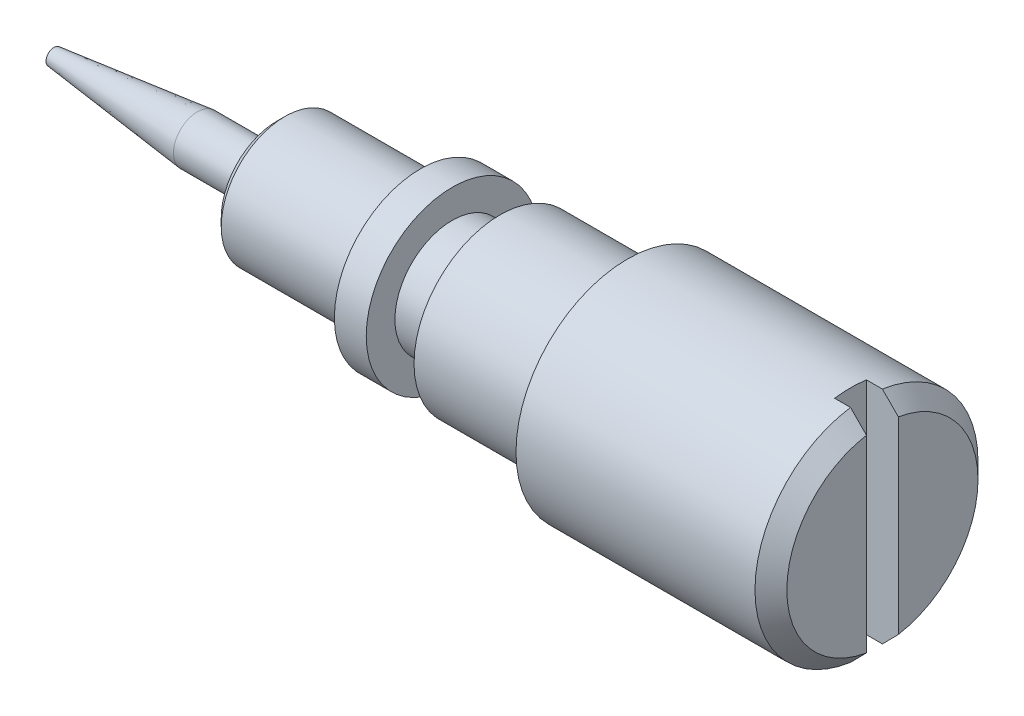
ISO-10303-21;
HEADER;
FILE_DESCRIPTION(('STEP AP214'),'2;1');
FILE_NAME('part.step','',(''),(''),'','','');
FILE_SCHEMA(('AUTOMOTIVE_DESIGN { 1 0 10303 214 1 1 1 1 }'));
ENDSEC;
DATA;
#1=APPLICATION_CONTEXT('core data for automotive mechanical design processes');
#2=APPLICATION_PROTOCOL_DEFINITION('international standard','automotive_design',2000,#1);
#3=PRODUCT_CONTEXT('',#1,'mechanical');
#4=PRODUCT('Part','Part','',(#3));
#5=PRODUCT_RELATED_PRODUCT_CATEGORY('part','',(#4));
#6=PRODUCT_DEFINITION_FORMATION('','',#4);
#7=PRODUCT_DEFINITION_CONTEXT('part definition',#1,'design');
#8=PRODUCT_DEFINITION('design','',#6,#7);
#9=PRODUCT_DEFINITION_SHAPE('','',#8);
#10=(LENGTH_UNIT() NAMED_UNIT(*) SI_UNIT(.MILLI.,.METRE.));
#11=(NAMED_UNIT(*) PLANE_ANGLE_UNIT() SI_UNIT($,.RADIAN.));
#12=(NAMED_UNIT(*) SI_UNIT($,.STERADIAN.) SOLID_ANGLE_UNIT());
#13=UNCERTAINTY_MEASURE_WITH_UNIT(LENGTH_MEASURE(1.E-05),#10,'distance_accuracy_value','');
#14=(GEOMETRIC_REPRESENTATION_CONTEXT(3) GLOBAL_UNCERTAINTY_ASSIGNED_CONTEXT((#13)) GLOBAL_UNIT_ASSIGNED_CONTEXT((#10,
#11,#12)) REPRESENTATION_CONTEXT('',''));
#15=CARTESIAN_POINT('',(0.,0.,0.));
#16=DIRECTION('',(0.,0.,1.));
#17=DIRECTION('',(1.,0.,0.));
#18=AXIS2_PLACEMENT_3D('',#15,#16,#17);
#19=CARTESIAN_POINT('',(-23.,0.,0.));
#20=DIRECTION('',(-1.,0.,0.));
#21=DIRECTION('',(0.,0.,1.));
#22=AXIS2_PLACEMENT_3D('',#19,#20,#21);
#23=PLANE('',#22);
#24=CARTESIAN_POINT('',(-23.,0.,0.));
#25=DIRECTION('',(-1.,0.,0.));
#26=DIRECTION('',(0.,0.,1.));
#27=AXIS2_PLACEMENT_3D('',#24,#25,#26);
#28=CIRCLE('',#27,1.25);
#29=CARTESIAN_POINT('',(-23.,0.,1.25));
#30=VERTEX_POINT('',#29);
#31=EDGE_CURVE('E11',#30,#30,#28,.F.);
#32=ORIENTED_EDGE('',*,*,#31,.T.);
#33=EDGE_LOOP('',(#32));
#34=FACE_BOUND('',#33,.T.);
#35=CARTESIAN_POINT('',(-23.,0.,0.));
#36=DIRECTION('',(-1.,0.,0.));
#37=DIRECTION('',(0.,0.,1.));
#38=AXIS2_PLACEMENT_3D('',#35,#36,#37);
#39=CIRCLE('',#38,1.75);
#40=CARTESIAN_POINT('',(-23.,0.,1.75));
#41=VERTEX_POINT('',#40);
#42=EDGE_CURVE('E567',#41,#41,#39,.T.);
#43=ORIENTED_EDGE('',*,*,#42,.T.);
#44=EDGE_LOOP('',(#43));
#45=FACE_BOUND('',#44,.T.);
#46=ADVANCED_FACE('F350',(#34,#45),#23,.T.);
#47=CARTESIAN_POINT('',(-18.5,0.,0.));
#48=DIRECTION('',(-1.,0.,0.));
#49=DIRECTION('',(0.,0.,1.));
#50=AXIS2_PLACEMENT_3D('',#47,#48,#49);
#51=PLANE('',#50);
#52=CARTESIAN_POINT('',(-18.5,0.,0.));
#53=DIRECTION('',(-1.,0.,0.));
#54=DIRECTION('',(0.,0.,1.));
#55=AXIS2_PLACEMENT_3D('',#52,#53,#54);
#56=CIRCLE('',#55,2.7);
#57=CARTESIAN_POINT('',(-18.5,0.,2.7));
#58=VERTEX_POINT('',#57);
#59=EDGE_CURVE('E458',#58,#58,#56,.T.);
#60=ORIENTED_EDGE('',*,*,#59,.T.);
#61=EDGE_LOOP('',(#60));
#62=FACE_BOUND('',#61,.T.);
#63=CARTESIAN_POINT('',(-18.5,0.,0.));
#64=DIRECTION('',(-1.,0.,0.));
#65=DIRECTION('',(0.,0.,1.));
#66=AXIS2_PLACEMENT_3D('',#63,#64,#65);
#67=CIRCLE('',#66,2.);
#68=CARTESIAN_POINT('',(-18.5,0.,2.));
#69=VERTEX_POINT('',#68);
#70=EDGE_CURVE('E423',#69,#69,#67,.T.);
#71=ORIENTED_EDGE('',*,*,#70,.F.);
#72=EDGE_LOOP('',(#71));
#73=FACE_BOUND('',#72,.T.);
#74=ADVANCED_FACE('F490',(#62,#73),#51,.T.);
#75=CARTESIAN_POINT('',(-5.,0.,0.));
#76=DIRECTION('',(1.,0.,0.));
#77=DIRECTION('',(0.,0.,-1.));
#78=AXIS2_PLACEMENT_3D('',#75,#76,#77);
#79=PLANE('',#78);
#80=CARTESIAN_POINT('',(-5.,0.,0.));
#81=DIRECTION('',(1.,0.,0.));
#82=DIRECTION('',(0.,0.,-1.));
#83=AXIS2_PLACEMENT_3D('',#80,#81,#82);
#84=CIRCLE('',#83,3.5);
#85=CARTESIAN_POINT('',(-5.,-3.46410161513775,0.5));
#86=VERTEX_POINT('',#85);
#87=CARTESIAN_POINT('',(-5.,-3.46410161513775,-0.5));
#88=VERTEX_POINT('',#87);
#89=EDGE_CURVE('E408',#86,#88,#84,.T.);
#90=ORIENTED_EDGE('',*,*,#89,.T.);
#91=DIRECTION('',(0.,-1.,0.));
#92=VECTOR('',#91,1.);
#93=CARTESIAN_POINT('',(-5.,-3.46410161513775,-0.5));
#94=LINE('',#93,#92);
#95=CARTESIAN_POINT('',(-5.,3.46410161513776,-0.5));
#96=VERTEX_POINT('',#95);
#97=EDGE_CURVE('E418',#96,#88,#94,.T.);
#98=ORIENTED_EDGE('',*,*,#97,.F.);
#99=CARTESIAN_POINT('',(-5.,3.46410161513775,0.5));
#100=VERTEX_POINT('',#99);
#101=EDGE_CURVE('E429',#96,#100,#84,.T.);
#102=ORIENTED_EDGE('',*,*,#101,.T.);
#103=DIRECTION('',(0.,-1.,0.));
#104=VECTOR('',#103,1.);
#105=CARTESIAN_POINT('',(-5.,3.46410161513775,0.5));
#106=LINE('',#105,#104);
#107=EDGE_CURVE('E428',#100,#86,#106,.T.);
#108=ORIENTED_EDGE('',*,*,#107,.T.);
#109=EDGE_LOOP('',(#90,#98,#102,#108));
#110=FACE_BOUND('',#109,.T.);
#111=ADVANCED_FACE('F426',(#110),#79,.T.);
#112=CARTESIAN_POINT('',(-4.,0.,0.));
#113=DIRECTION('',(-1.,0.,0.));
#114=DIRECTION('',(0.,0.,1.));
#115=AXIS2_PLACEMENT_3D('',#112,#113,#114);
#116=CYLINDRICAL_SURFACE('',#115,3.5);
#117=DIRECTION('',(1.,0.,0.));
#118=VECTOR('',#117,1.);
#119=CARTESIAN_POINT('',(-5.,-3.46410161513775,0.5));
#120=LINE('',#119,#118);
#121=CARTESIAN_POINT('',(-4.5,-3.46410161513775,0.5));
#122=VERTEX_POINT('',#121);
#123=EDGE_CURVE('E437',#86,#122,#120,.T.);
#124=ORIENTED_EDGE('',*,*,#123,.T.);
#125=CARTESIAN_POINT('',(-4.5,0.,0.));
#126=DIRECTION('',(1.,0.,0.));
#127=DIRECTION('',(0.,0.,-1.));
#128=AXIS2_PLACEMENT_3D('',#125,#126,#127);
#129=CIRCLE('',#128,3.5);
#130=CARTESIAN_POINT('',(-4.5,3.46410161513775,0.5));
#131=VERTEX_POINT('',#130);
#132=EDGE_CURVE('E565',#122,#131,#129,.F.);
#133=ORIENTED_EDGE('',*,*,#132,.T.);
#134=DIRECTION('',(1.,0.,0.));
#135=VECTOR('',#134,1.);
#136=CARTESIAN_POINT('',(-5.,3.46410161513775,0.5));
#137=LINE('',#136,#135);
#138=EDGE_CURVE('E431',#100,#131,#137,.T.);
#139=ORIENTED_EDGE('',*,*,#138,.F.);
#140=ORIENTED_EDGE('',*,*,#101,.F.);
#141=DIRECTION('',(-1.,0.,0.));
#142=VECTOR('',#141,1.);
#143=CARTESIAN_POINT('',(-4.,3.46410161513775,-0.5));
#144=LINE('',#143,#142);
#145=CARTESIAN_POINT('',(-4.5,3.46410161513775,-0.5));
#146=VERTEX_POINT('',#145);
#147=EDGE_CURVE('E414',#146,#96,#144,.T.);
#148=ORIENTED_EDGE('',*,*,#147,.F.);
#149=CARTESIAN_POINT('',(-4.5,0.,0.));
#150=DIRECTION('',(-1.,0.,0.));
#151=DIRECTION('',(0.,0.,1.));
#152=AXIS2_PLACEMENT_3D('',#149,#150,#151);
#153=CIRCLE('',#152,3.5);
#154=CARTESIAN_POINT('',(-4.5,-3.46410161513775,-0.5));
#155=VERTEX_POINT('',#154);
#156=EDGE_CURVE('E411',#146,#155,#153,.T.);
#157=ORIENTED_EDGE('',*,*,#156,.T.);
#158=DIRECTION('',(-1.,0.,0.));
#159=VECTOR('',#158,1.);
#160=CARTESIAN_POINT('',(-4.,-3.46410161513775,-0.5));
#161=LINE('',#160,#159);
#162=EDGE_CURVE('E403',#155,#88,#161,.T.);
#163=ORIENTED_EDGE('',*,*,#162,.T.);
#164=ORIENTED_EDGE('',*,*,#89,.F.);
#165=EDGE_LOOP('',(#124,#133,#139,#140,#148,#157,#163,#164));
#166=FACE_BOUND('',#165,.T.);
#167=CARTESIAN_POINT('',(-12.,0.,0.));
#168=DIRECTION('',(-1.,0.,0.));
#169=DIRECTION('',(0.,0.,1.));
#170=AXIS2_PLACEMENT_3D('',#167,#168,#169);
#171=CIRCLE('',#170,3.5);
#172=CARTESIAN_POINT('',(-12.,0.,3.5));
#173=VERTEX_POINT('',#172);
#174=EDGE_CURVE('E439',#173,#173,#171,.T.);
#175=ORIENTED_EDGE('',*,*,#174,.F.);
#176=EDGE_LOOP('',(#175));
#177=FACE_BOUND('',#176,.T.);
#178=ADVANCED_FACE('F352',(#166,#177),#116,.T.);
#179=CARTESIAN_POINT('',(-4.,3.5,0.));
#180=DIRECTION('',(1.,0.,0.));
#181=DIRECTION('',(0.,0.,-1.));
#182=AXIS2_PLACEMENT_3D('',#179,#180,#181);
#183=PLANE('',#182);
#184=DIRECTION('',(0.,-1.,0.));
#185=VECTOR('',#184,1.);
#186=CARTESIAN_POINT('',(-4.,3.46410161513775,0.5));
#187=LINE('',#186,#185);
#188=CARTESIAN_POINT('',(-4.,2.95803989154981,0.5));
#189=VERTEX_POINT('',#188);
#190=CARTESIAN_POINT('',(-4.,-2.95803989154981,0.5));
#191=VERTEX_POINT('',#190);
#192=EDGE_CURVE('E433',#189,#191,#187,.T.);
#193=ORIENTED_EDGE('',*,*,#192,.F.);
#194=CARTESIAN_POINT('',(-4.,0.,0.));
#195=DIRECTION('',(1.,0.,0.));
#196=DIRECTION('',(0.,0.,-1.));
#197=AXIS2_PLACEMENT_3D('',#194,#195,#196);
#198=CIRCLE('',#197,3.);
#199=EDGE_CURVE('E364',#189,#191,#198,.T.);
#200=ORIENTED_EDGE('',*,*,#199,.T.);
#201=EDGE_LOOP('',(#193,#200));
#202=FACE_BOUND('',#201,.T.);
#203=ADVANCED_FACE('F632',(#202),#183,.T.);
#204=CARTESIAN_POINT('',(-4.,0.,0.));
#205=DIRECTION('',(-1.,0.,0.));
#206=DIRECTION('',(0.,0.,1.));
#207=AXIS2_PLACEMENT_3D('',#204,#205,#206);
#208=CYLINDRICAL_SURFACE('',#207,2.7);
#209=CARTESIAN_POINT('',(-17.5,0.,0.));
#210=DIRECTION('',(-1.,0.,0.));
#211=DIRECTION('',(0.,0.,1.));
#212=AXIS2_PLACEMENT_3D('',#209,#210,#211);
#213=CIRCLE('',#212,2.7);
#214=CARTESIAN_POINT('',(-17.5,0.,2.7));
#215=VERTEX_POINT('',#214);
#216=EDGE_CURVE('E455',#215,#215,#213,.T.);
#217=ORIENTED_EDGE('',*,*,#216,.T.);
#218=EDGE_LOOP('',(#217));
#219=FACE_BOUND('',#218,.T.);
#220=ORIENTED_EDGE('',*,*,#59,.F.);
#221=EDGE_LOOP('',(#220));
#222=FACE_BOUND('',#221,.T.);
#223=ADVANCED_FACE('F680',(#219,#222),#208,.T.);
#224=CARTESIAN_POINT('',(-17.5,2.7,0.));
#225=DIRECTION('',(1.,0.,0.));
#226=DIRECTION('',(0.,0.,-1.));
#227=AXIS2_PLACEMENT_3D('',#224,#225,#226);
#228=PLANE('',#227);
#229=CARTESIAN_POINT('',(-17.5,0.,0.));
#230=DIRECTION('',(-1.,0.,0.));
#231=DIRECTION('',(0.,0.,1.));
#232=AXIS2_PLACEMENT_3D('',#229,#230,#231);
#233=CIRCLE('',#232,1.8);
#234=CARTESIAN_POINT('',(-17.5,0.,1.8));
#235=VERTEX_POINT('',#234);
#236=EDGE_CURVE('E452',#235,#235,#233,.T.);
#237=ORIENTED_EDGE('',*,*,#236,.T.);
#238=EDGE_LOOP('',(#237));
#239=FACE_BOUND('',#238,.T.);
#240=ORIENTED_EDGE('',*,*,#216,.F.);
#241=EDGE_LOOP('',(#240));
#242=FACE_BOUND('',#241,.T.);
#243=ADVANCED_FACE('F672',(#239,#242),#228,.T.);
#244=CARTESIAN_POINT('',(-4.,0.,0.));
#245=DIRECTION('',(-1.,0.,0.));
#246=DIRECTION('',(0.,0.,1.));
#247=AXIS2_PLACEMENT_3D('',#244,#245,#246);
#248=CYLINDRICAL_SURFACE('',#247,1.8);
#249=CARTESIAN_POINT('',(-16.,0.,0.));
#250=DIRECTION('',(-1.,0.,0.));
#251=DIRECTION('',(0.,0.,1.));
#252=AXIS2_PLACEMENT_3D('',#249,#250,#251);
#253=CIRCLE('',#252,1.8);
#254=CARTESIAN_POINT('',(-16.,0.,1.8));
#255=VERTEX_POINT('',#254);
#256=EDGE_CURVE('E449',#255,#255,#253,.T.);
#257=ORIENTED_EDGE('',*,*,#256,.T.);
#258=EDGE_LOOP('',(#257));
#259=FACE_BOUND('',#258,.T.);
#260=ORIENTED_EDGE('',*,*,#236,.F.);
#261=EDGE_LOOP('',(#260));
#262=FACE_BOUND('',#261,.T.);
#263=ADVANCED_FACE('F664',(#259,#262),#248,.T.);
#264=CARTESIAN_POINT('',(-16.,1.8,0.));
#265=DIRECTION('',(-1.,0.,0.));
#266=DIRECTION('',(0.,0.,1.));
#267=AXIS2_PLACEMENT_3D('',#264,#265,#266);
#268=PLANE('',#267);
#269=CARTESIAN_POINT('',(-16.,0.,0.));
#270=DIRECTION('',(-1.,0.,0.));
#271=DIRECTION('',(0.,0.,1.));
#272=AXIS2_PLACEMENT_3D('',#269,#270,#271);
#273=CIRCLE('',#272,2.7);
#274=CARTESIAN_POINT('',(-16.,0.,2.7));
#275=VERTEX_POINT('',#274);
#276=EDGE_CURVE('E446',#275,#275,#273,.T.);
#277=ORIENTED_EDGE('',*,*,#276,.T.);
#278=EDGE_LOOP('',(#277));
#279=FACE_BOUND('',#278,.T.);
#280=ORIENTED_EDGE('',*,*,#256,.F.);
#281=EDGE_LOOP('',(#280));
#282=FACE_BOUND('',#281,.T.);
#283=ADVANCED_FACE('F657',(#279,#282),#268,.T.);
#284=CARTESIAN_POINT('',(-4.,0.,0.));
#285=DIRECTION('',(-1.,0.,0.));
#286=DIRECTION('',(0.,0.,1.));
#287=AXIS2_PLACEMENT_3D('',#284,#285,#286);
#288=CYLINDRICAL_SURFACE('',#287,2.7);
#289=CARTESIAN_POINT('',(-12.,0.,0.));
#290=DIRECTION('',(-1.,0.,0.));
#291=DIRECTION('',(0.,0.,1.));
#292=AXIS2_PLACEMENT_3D('',#289,#290,#291);
#293=CIRCLE('',#292,2.7);
#294=CARTESIAN_POINT('',(-12.,0.,2.7));
#295=VERTEX_POINT('',#294);
#296=EDGE_CURVE('E443',#295,#295,#293,.T.);
#297=ORIENTED_EDGE('',*,*,#296,.T.);
#298=EDGE_LOOP('',(#297));
#299=FACE_BOUND('',#298,.T.);
#300=ORIENTED_EDGE('',*,*,#276,.F.);
#301=EDGE_LOOP('',(#300));
#302=FACE_BOUND('',#301,.T.);
#303=ADVANCED_FACE('F650',(#299,#302),#288,.T.);
#304=CARTESIAN_POINT('',(-12.,2.7,0.));
#305=DIRECTION('',(-1.,0.,0.));
#306=DIRECTION('',(0.,0.,1.));
#307=AXIS2_PLACEMENT_3D('',#304,#305,#306);
#308=PLANE('',#307);
#309=ORIENTED_EDGE('',*,*,#174,.T.);
#310=EDGE_LOOP('',(#309));
#311=FACE_BOUND('',#310,.T.);
#312=ORIENTED_EDGE('',*,*,#296,.F.);
#313=EDGE_LOOP('',(#312));
#314=FACE_BOUND('',#313,.T.);
#315=ADVANCED_FACE('F494',(#311,#314),#308,.T.);
#316=CARTESIAN_POINT('',(-5.,3.46410161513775,0.5));
#317=DIRECTION('',(0.,0.,1.));
#318=DIRECTION('',(0.,-1.,0.));
#319=AXIS2_PLACEMENT_3D('',#316,#317,#318);
#320=PLANE('',#319);
#321=ORIENTED_EDGE('',*,*,#138,.T.);
#322=CARTESIAN_POINT('',(-4.5,3.46410161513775,0.5));
#323=CARTESIAN_POINT('',(-4.41658754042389,3.3798361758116,0.5));
#324=CARTESIAN_POINT('',(-4.33321464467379,3.29553164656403,0.5));
#325=CARTESIAN_POINT('',(-4.16654797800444,3.12684440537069,0.5));
#326=CARTESIAN_POINT('',(-4.08325420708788,3.04246169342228,0.5));
#327=CARTESIAN_POINT('',(-4.,2.95803989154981,0.5));
#328=B_SPLINE_CURVE_WITH_KNOTS('',3,(#322,#323,#324,#325,#326,#327),.UNSPECIFIED.,.F.,.F.,(4,2,
4),(0.,0.355703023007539,0.711406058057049),.UNSPECIFIED.);
#329=EDGE_CURVE('E371',#131,#189,#328,.T.);
#330=ORIENTED_EDGE('',*,*,#329,.T.);
#331=ORIENTED_EDGE('',*,*,#192,.T.);
#332=CARTESIAN_POINT('',(-4.,-2.95803989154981,0.5));
#333=CARTESIAN_POINT('',(-4.08325420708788,-3.04246169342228,0.5));
#334=CARTESIAN_POINT('',(-4.16654797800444,-3.12684440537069,0.5));
#335=CARTESIAN_POINT('',(-4.33321464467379,-3.29553164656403,0.5));
#336=CARTESIAN_POINT('',(-4.41658754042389,-3.3798361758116,0.5));
#337=CARTESIAN_POINT('',(-4.5,-3.46410161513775,0.5));
#338=B_SPLINE_CURVE_WITH_KNOTS('',3,(#332,#333,#334,#335,#336,#337),.UNSPECIFIED.,.F.,.F.,(4,2,
4),(0.,0.35570303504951,0.711406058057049),.UNSPECIFIED.);
#339=EDGE_CURVE('E498',#191,#122,#338,.T.);
#340=ORIENTED_EDGE('',*,*,#339,.T.);
#341=ORIENTED_EDGE('',*,*,#123,.F.);
#342=ORIENTED_EDGE('',*,*,#107,.F.);
#343=EDGE_LOOP('',(#321,#330,#331,#340,#341,#342));
#344=FACE_BOUND('',#343,.T.);
#345=ADVANCED_FACE('F485',(#344),#320,.F.);
#346=CARTESIAN_POINT('',(-4.,-3.46410161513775,-0.5));
#347=DIRECTION('',(0.,0.,-1.));
#348=DIRECTION('',(-1.,0.,0.));
#349=AXIS2_PLACEMENT_3D('',#346,#347,#348);
#350=PLANE('',#349);
#351=DIRECTION('',(0.,-1.,0.));
#352=VECTOR('',#351,1.);
#353=CARTESIAN_POINT('',(-4.,-3.46410161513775,-0.5));
#354=LINE('',#353,#352);
#355=CARTESIAN_POINT('',(-4.,2.95803989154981,-0.5));
#356=VERTEX_POINT('',#355);
#357=CARTESIAN_POINT('',(-4.,-2.95803989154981,-0.5));
#358=VERTEX_POINT('',#357);
#359=EDGE_CURVE('E415',#356,#358,#354,.T.);
#360=ORIENTED_EDGE('',*,*,#359,.F.);
#361=CARTESIAN_POINT('',(-4.,2.95803989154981,-0.5));
#362=CARTESIAN_POINT('',(-4.08325420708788,3.04246169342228,-0.5));
#363=CARTESIAN_POINT('',(-4.16654797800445,3.1268444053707,-0.5));
#364=CARTESIAN_POINT('',(-4.33321464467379,3.29553164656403,-0.5));
#365=CARTESIAN_POINT('',(-4.41658754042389,3.3798361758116,-0.5));
#366=CARTESIAN_POINT('',(-4.5,3.46410161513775,-0.5));
#367=B_SPLINE_CURVE_WITH_KNOTS('',3,(#361,#362,#363,#364,#365,#366),.UNSPECIFIED.,.F.,.F.,(4,2,
4),(0.,0.35570303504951,0.711406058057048),.UNSPECIFIED.);
#368=EDGE_CURVE('E471',#356,#146,#367,.T.);
#369=ORIENTED_EDGE('',*,*,#368,.T.);
#370=ORIENTED_EDGE('',*,*,#147,.T.);
#371=ORIENTED_EDGE('',*,*,#97,.T.);
#372=ORIENTED_EDGE('',*,*,#162,.F.);
#373=CARTESIAN_POINT('',(-4.5,-3.46410161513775,-0.5));
#374=CARTESIAN_POINT('',(-4.41658754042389,-3.3798361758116,-0.5));
#375=CARTESIAN_POINT('',(-4.33321464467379,-3.29553164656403,-0.5));
#376=CARTESIAN_POINT('',(-4.16654797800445,-3.12684440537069,-0.5));
#377=CARTESIAN_POINT('',(-4.08325420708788,-3.04246169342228,-0.5));
#378=CARTESIAN_POINT('',(-4.,-2.95803989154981,-0.5));
#379=B_SPLINE_CURVE_WITH_KNOTS('',3,(#373,#374,#375,#376,#377,#378),.UNSPECIFIED.,.F.,.F.,(4,2,
4),(0.,0.355703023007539,0.711406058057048),.UNSPECIFIED.);
#380=EDGE_CURVE('E464',#155,#358,#379,.T.);
#381=ORIENTED_EDGE('',*,*,#380,.T.);
#382=EDGE_LOOP('',(#360,#369,#370,#371,#372,#381));
#383=FACE_BOUND('',#382,.T.);
#384=ADVANCED_FACE('F420',(#383),#350,.F.);
#385=CARTESIAN_POINT('',(-4.,0.,0.));
#386=DIRECTION('',(-1.,0.,0.));
#387=DIRECTION('',(0.,0.,1.));
#388=AXIS2_PLACEMENT_3D('',#385,#386,#387);
#389=PLANE('',#388);
#390=ORIENTED_EDGE('',*,*,#359,.T.);
#391=CARTESIAN_POINT('',(-4.,0.,0.));
#392=DIRECTION('',(-1.,0.,0.));
#393=DIRECTION('',(0.,0.,1.));
#394=AXIS2_PLACEMENT_3D('',#391,#392,#393);
#395=CIRCLE('',#394,3.);
#396=EDGE_CURVE('E461',#358,#356,#395,.F.);
#397=ORIENTED_EDGE('',*,*,#396,.T.);
#398=EDGE_LOOP('',(#390,#397));
#399=FACE_BOUND('',#398,.T.);
#400=ADVANCED_FACE('F484',(#399),#389,.F.);
#401=CARTESIAN_POINT('',(-23.,0.,0.));
#402=DIRECTION('',(1.,0.,0.));
#403=DIRECTION('',(0.,0.,-1.));
#404=AXIS2_PLACEMENT_3D('',#401,#402,#403);
#405=CYLINDRICAL_SURFACE('',#404,2.);
#406=CARTESIAN_POINT('',(-22.75,0.,0.));
#407=DIRECTION('',(-1.,0.,0.));
#408=DIRECTION('',(0.,0.,1.));
#409=AXIS2_PLACEMENT_3D('',#406,#407,#408);
#410=CIRCLE('',#409,2.);
#411=CARTESIAN_POINT('',(-22.75,0.,2.));
#412=VERTEX_POINT('',#411);
#413=EDGE_CURVE('E550',#412,#412,#410,.F.);
#414=ORIENTED_EDGE('',*,*,#413,.T.);
#415=EDGE_LOOP('',(#414));
#416=FACE_BOUND('',#415,.T.);
#417=ORIENTED_EDGE('',*,*,#70,.T.);
#418=EDGE_LOOP('',(#417));
#419=FACE_BOUND('',#418,.T.);
#420=ADVANCED_FACE('F538',(#416,#419),#405,.T.);
#421=CARTESIAN_POINT('',(-25.5,0.,0.));
#422=DIRECTION('',(1.,0.,0.));
#423=DIRECTION('',(0.,0.,-1.));
#424=AXIS2_PLACEMENT_3D('',#421,#422,#423);
#425=CYLINDRICAL_SURFACE('',#424,0.75);
#426=CARTESIAN_POINT('',(-23.5,0.,0.));
#427=DIRECTION('',(-1.,0.,0.));
#428=DIRECTION('',(0.,0.,1.));
#429=AXIS2_PLACEMENT_3D('',#426,#427,#428);
#430=CIRCLE('',#429,0.75);
#431=CARTESIAN_POINT('',(-23.5,0.,0.75));
#432=VERTEX_POINT('',#431);
#433=EDGE_CURVE('E358',#432,#432,#430,.T.);
#434=ORIENTED_EDGE('',*,*,#433,.T.);
#435=EDGE_LOOP('',(#434));
#436=FACE_BOUND('',#435,.T.);
#437=CARTESIAN_POINT('',(-25.5,0.,0.));
#438=DIRECTION('',(-1.,0.,0.));
#439=DIRECTION('',(0.,0.,1.));
#440=AXIS2_PLACEMENT_3D('',#437,#438,#439);
#441=CIRCLE('',#440,0.75);
#442=CARTESIAN_POINT('',(-25.5,0.,0.75));
#443=VERTEX_POINT('',#442);
#444=EDGE_CURVE('E554',#443,#443,#441,.T.);
#445=ORIENTED_EDGE('',*,*,#444,.F.);
#446=EDGE_LOOP('',(#445));
#447=FACE_BOUND('',#446,.T.);
#448=ADVANCED_FACE('F536',(#436,#447),#425,.T.);
#449=CARTESIAN_POINT('',(-25.5,0.,0.));
#450=DIRECTION('',(1.,0.,0.));
#451=DIRECTION('',(0.,0.,1.));
#452=AXIS2_PLACEMENT_3D('',#449,#450,#451);
#453=CONICAL_SURFACE('',#452,0.75,0.110657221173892);
#454=CARTESIAN_POINT('',(-30.,0.,0.));
#455=DIRECTION('',(-1.,0.,0.));
#456=DIRECTION('',(0.,0.,1.));
#457=AXIS2_PLACEMENT_3D('',#454,#455,#456);
#458=CIRCLE('',#457,0.250000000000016);
#459=CARTESIAN_POINT('',(-30.,0.,0.250000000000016));
#460=VERTEX_POINT('',#459);
#461=EDGE_CURVE('E557',#460,#460,#458,.T.);
#462=CARTESIAN_POINT('',(-30.,0.,0.250000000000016));
#463=CARTESIAN_POINT('',(-29.953125,0.,0.255208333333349));
#464=CARTESIAN_POINT('',(-29.90625,0.,0.260416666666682));
#465=CARTESIAN_POINT('',(-29.8125,0.,0.270833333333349));
#466=CARTESIAN_POINT('',(-29.765625,0.,0.276041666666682));
#467=CARTESIAN_POINT('',(-29.671875,0.,0.286458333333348));
#468=CARTESIAN_POINT('',(-29.625,0.,0.291666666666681));
#469=CARTESIAN_POINT('',(-29.53125,0.,0.302083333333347));
#470=CARTESIAN_POINT('',(-29.484375,0.,0.307291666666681));
#471=CARTESIAN_POINT('',(-29.390625,0.,0.317708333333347));
#472=CARTESIAN_POINT('',(-29.34375,0.,0.32291666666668));
#473=CARTESIAN_POINT('',(-29.25,0.,0.333333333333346));
#474=CARTESIAN_POINT('',(-29.203125,0.,0.33854166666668));
#475=CARTESIAN_POINT('',(-29.109375,0.,0.348958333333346));
#476=CARTESIAN_POINT('',(-29.0625,0.,0.354166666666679));
#477=CARTESIAN_POINT('',(-28.96875,0.,0.364583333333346));
#478=CARTESIAN_POINT('',(-28.921875,0.,0.369791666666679));
#479=CARTESIAN_POINT('',(-28.828125,0.,0.380208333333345));
#480=CARTESIAN_POINT('',(-28.78125,0.,0.385416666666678));
#481=CARTESIAN_POINT('',(-28.6875,0.,0.395833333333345));
#482=CARTESIAN_POINT('',(-28.640625,0.,0.401041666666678));
#483=CARTESIAN_POINT('',(-28.546875,0.,0.411458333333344));
#484=CARTESIAN_POINT('',(-28.5,0.,0.416666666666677));
#485=CARTESIAN_POINT('',(-28.40625,0.,0.427083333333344));
#486=CARTESIAN_POINT('',(-28.359375,0.,0.432291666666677));
#487=CARTESIAN_POINT('',(-28.265625,0.,0.442708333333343));
#488=CARTESIAN_POINT('',(-28.21875,0.,0.447916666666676));
#489=CARTESIAN_POINT('',(-28.125,0.,0.458333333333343));
#490=CARTESIAN_POINT('',(-28.078125,0.,0.463541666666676));
#491=CARTESIAN_POINT('',(-27.984375,0.,0.473958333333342));
#492=CARTESIAN_POINT('',(-27.9375,0.,0.479166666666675));
#493=CARTESIAN_POINT('',(-27.84375,0.,0.489583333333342));
#494=CARTESIAN_POINT('',(-27.796875,0.,0.494791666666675));
#495=CARTESIAN_POINT('',(-27.703125,0.,0.505208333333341));
#496=CARTESIAN_POINT('',(-27.65625,0.,0.510416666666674));
#497=CARTESIAN_POINT('',(-27.5625,0.,0.520833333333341));
#498=CARTESIAN_POINT('',(-27.515625,0.,0.526041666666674));
#499=CARTESIAN_POINT('',(-27.421875,0.,0.53645833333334));
#500=CARTESIAN_POINT('',(-27.375,0.,0.541666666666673));
#501=CARTESIAN_POINT('',(-27.28125,0.,0.55208333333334));
#502=CARTESIAN_POINT('',(-27.234375,0.,0.557291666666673));
#503=CARTESIAN_POINT('',(-27.140625,0.,0.567708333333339));
#504=CARTESIAN_POINT('',(-27.09375,0.,0.572916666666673));
#505=CARTESIAN_POINT('',(-27.,0.,0.583333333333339));
#506=CARTESIAN_POINT('',(-26.953125,0.,0.588541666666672));
#507=CARTESIAN_POINT('',(-26.859375,0.,0.598958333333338));
#508=CARTESIAN_POINT('',(-26.8125,0.,0.604166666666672));
#509=CARTESIAN_POINT('',(-26.71875,0.,0.614583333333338));
#510=CARTESIAN_POINT('',(-26.671875,0.,0.619791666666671));
#511=CARTESIAN_POINT('',(-26.578125,0.,0.630208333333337));
#512=CARTESIAN_POINT('',(-26.53125,0.,0.635416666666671));
#513=CARTESIAN_POINT('',(-26.4375,0.,0.645833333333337));
#514=CARTESIAN_POINT('',(-26.390625,0.,0.65104166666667));
#515=CARTESIAN_POINT('',(-26.296875,0.,0.661458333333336));
#516=CARTESIAN_POINT('',(-26.25,0.,0.66666666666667));
#517=CARTESIAN_POINT('',(-26.15625,0.,0.677083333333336));
#518=CARTESIAN_POINT('',(-26.109375,0.,0.682291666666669));
#519=CARTESIAN_POINT('',(-26.015625,0.,0.692708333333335));
#520=CARTESIAN_POINT('',(-25.96875,0.,0.697916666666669));
#521=CARTESIAN_POINT('',(-25.875,0.,0.708333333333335));
#522=CARTESIAN_POINT('',(-25.828125,0.,0.713541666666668));
#523=CARTESIAN_POINT('',(-25.734375,0.,0.723958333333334));
#524=CARTESIAN_POINT('',(-25.6875,0.,0.729166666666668));
#525=CARTESIAN_POINT('',(-25.59375,0.,0.739583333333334));
#526=CARTESIAN_POINT('',(-25.546875,0.,0.744791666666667));
#527=CARTESIAN_POINT('',(-25.5,0.,0.75));
#528=B_SPLINE_CURVE_WITH_KNOTS('',3,(#462,#463,#464,#465,#466,#467,#468,#469,#470,#471,#472,
#473,#474,#475,#476,#477,#478,#479,#480,#481,#482,#483,#484,#485,#486,#487,#488,#489,#490,#491,
#492,#493,#494,#495,#496,#497,#498,#499,#500,#501,#502,#503,#504,#505,#506,#507,#508,#509,#510,
#511,#512,#513,#514,#515,#516,#517,#518,#519,#520,#521,#522,#523,#524,#525,#526,#527),
.UNSPECIFIED.,.F.,.F.,(4,2,2,2,2,2,2,2,2,2,2,2,2,2,2,2,2,2,2,2,2,2,2,2,2,2,2,2,2,2,2,2,4),(0.,
0.141490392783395,0.282980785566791,0.42447117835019,0.565961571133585,0.707451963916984,
0.84894235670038,0.990432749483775,1.13192314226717,1.27341353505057,1.41490392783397,
1.55639432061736,1.69788471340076,1.83937510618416,1.98086549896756,2.12235589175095,
2.26384628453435,2.40533667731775,2.54682707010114,2.68831746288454,2.82980785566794,
2.97129824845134,3.11278864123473,3.25427903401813,3.39576942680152,3.53725981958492,
3.67875021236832,3.82024060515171,3.96173099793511,4.10322139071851,4.2447117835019,
4.3862021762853,4.5276925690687),.UNSPECIFIED.);
#529=EDGE_CURVE('BSEAM545',#460,#443,#528,.T.);
#530=ORIENTED_EDGE('',*,*,#461,.F.);
#531=ORIENTED_EDGE('',*,*,#444,.T.);
#532=ORIENTED_EDGE('',*,*,#529,.T.);
#533=ORIENTED_EDGE('',*,*,#529,.F.);
#534=EDGE_LOOP('',(#530,#532,#531,#533));
#535=FACE_BOUND('',#534,.T.);
#536=ADVANCED_FACE('F545',(#535),#453,.T.);
#537=CARTESIAN_POINT('',(-30.,0.,0.));
#538=DIRECTION('',(-1.,0.,0.));
#539=DIRECTION('',(0.,0.,1.));
#540=AXIS2_PLACEMENT_3D('',#537,#538,#539);
#541=PLANE('',#540);
#542=ORIENTED_EDGE('',*,*,#461,.T.);
#543=EDGE_LOOP('',(#542));
#544=FACE_BOUND('',#543,.T.);
#545=ADVANCED_FACE('F522',(#544),#541,.T.);
#546=CARTESIAN_POINT('',(-4.,0.,0.));
#547=DIRECTION('',(-1.,0.,0.));
#548=DIRECTION('',(0.,0.,1.));
#549=AXIS2_PLACEMENT_3D('',#546,#547,#548);
#550=CONICAL_SURFACE('',#549,3.,0.785398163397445);
#551=ORIENTED_EDGE('',*,*,#380,.F.);
#552=ORIENTED_EDGE('',*,*,#156,.F.);
#553=ORIENTED_EDGE('',*,*,#368,.F.);
#554=ORIENTED_EDGE('',*,*,#396,.F.);
#555=EDGE_LOOP('',(#551,#552,#553,#554));
#556=FACE_BOUND('',#555,.T.);
#557=ADVANCED_FACE('F476',(#556),#550,.T.);
#558=CARTESIAN_POINT('',(-23.,0.,0.));
#559=DIRECTION('',(1.,0.,0.));
#560=DIRECTION('',(0.,0.,-1.));
#561=AXIS2_PLACEMENT_3D('',#558,#559,#560);
#562=CONICAL_SURFACE('',#561,1.75,0.785398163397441);
#563=ORIENTED_EDGE('',*,*,#413,.F.);
#564=EDGE_LOOP('',(#563));
#565=FACE_BOUND('',#564,.T.);
#566=ORIENTED_EDGE('',*,*,#42,.F.);
#567=EDGE_LOOP('',(#566));
#568=FACE_BOUND('',#567,.T.);
#569=ADVANCED_FACE('F514',(#565,#568),#562,.T.);
#570=CARTESIAN_POINT('',(-4.5,0.,0.));
#571=DIRECTION('',(-1.,0.,0.));
#572=DIRECTION('',(0.,0.,1.));
#573=AXIS2_PLACEMENT_3D('',#570,#571,#572);
#574=CONICAL_SURFACE('',#573,3.5,0.785398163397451);
#575=ORIENTED_EDGE('',*,*,#339,.F.);
#576=ORIENTED_EDGE('',*,*,#199,.F.);
#577=ORIENTED_EDGE('',*,*,#329,.F.);
#578=ORIENTED_EDGE('',*,*,#132,.F.);
#579=EDGE_LOOP('',(#575,#576,#577,#578));
#580=FACE_BOUND('',#579,.T.);
#581=ADVANCED_FACE('F509',(#580),#574,.T.);
#582=CARTESIAN_POINT('',(-23.5,0.,0.));
#583=DIRECTION('',(-1.,0.,0.));
#584=DIRECTION('',(0.,0.,1.));
#585=AXIS2_PLACEMENT_3D('',#582,#583,#584);
#586=TOROIDAL_SURFACE('',#585,1.25,0.500000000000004);
#587=ORIENTED_EDGE('',*,*,#31,.F.);
#588=EDGE_LOOP('',(#587));
#589=FACE_BOUND('',#588,.T.);
#590=ORIENTED_EDGE('',*,*,#433,.F.);
#591=EDGE_LOOP('',(#590));
#592=FACE_BOUND('',#591,.T.);
#593=ADVANCED_FACE('F513',(#589,#592),#586,.F.);
#594=CLOSED_SHELL('',(#46,#74,#111,#178,#203,#223,#243,#263,#283,#303,#315,#345,#384,#400,#420,
#448,#536,#545,#557,#569,#581,#593));
#595=MANIFOLD_SOLID_BREP('B2',#594);
#596=ADVANCED_BREP_SHAPE_REPRESENTATION('',(#18,#595),#14);
#597=SHAPE_DEFINITION_REPRESENTATION(#9,#596);
ENDSEC;
END-ISO-10303-21;
